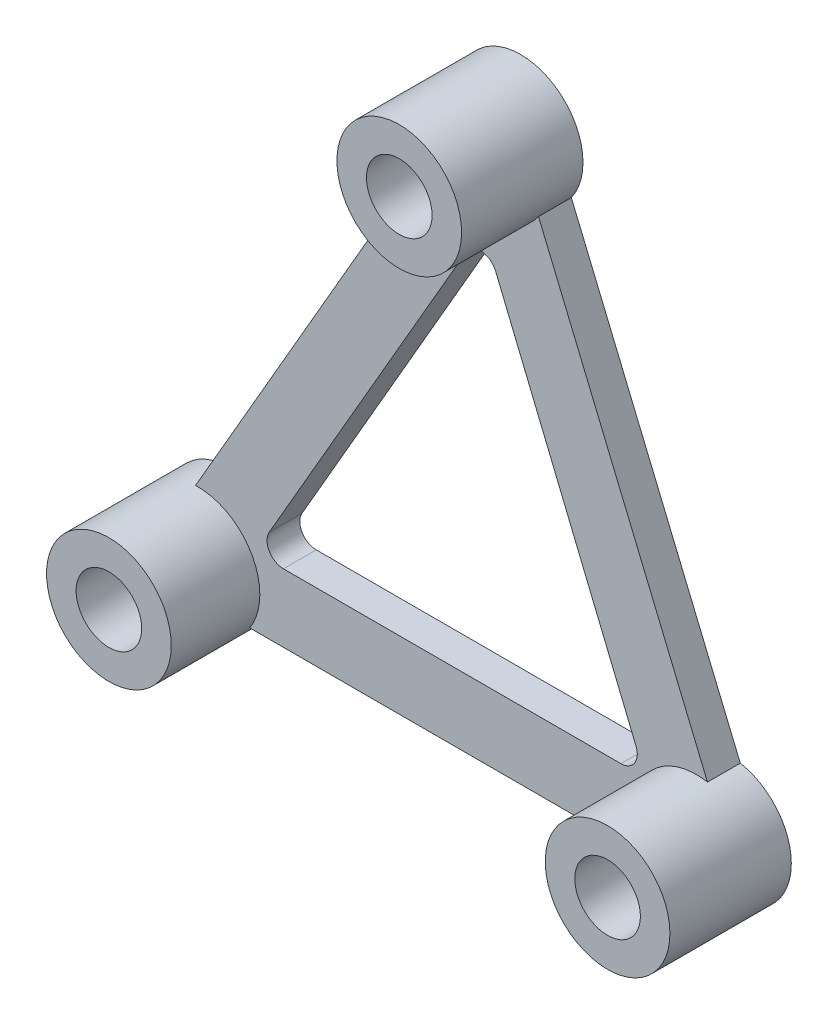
from build123d import *

# Parameters (mm, degrees)
BOSS_EXTRU_1_DEPTH      = 2
CONG_1_R                = 1
BOSS_EXTRU_2_DEPTH      = 5.4
BOSS_EXTRU_2_DEPTH_BACK = 2
ESQUISSE2_R             = 3.8
ESQUISSE2_R_2           = 2


with BuildPart() as part:
    # Esquisse1 → Boss.-Extru.1 (new body)
    with BuildSketch(Plane.XY):
        with BuildLine():
            Line((15.967949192, 31.657299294), (-2.006186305, 0.52518339))
            ThreePointArc((-2.006186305, 0.52518339), (-1.641602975, -1.267178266), (0, -2.073789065))
            Line((0, -2.073789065), (30.4, -2.073789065))
            ThreePointArc((30.4, -2.073789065), (32.125593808, -1.150185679), (32.31413227, 0.797934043))
            Line((32.31413227, 0.797934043), (19.546024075, 31.42684144))
            ThreePointArc((19.546024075, 31.42684144), (17.828550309, 32.653163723), (15.967949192, 31.657299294))
        make_face()
        Polygon((27.303688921, 2.073789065), (17.398650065, 26.135345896), (3.506703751, 2.073789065), align=None, mode=Mode.SUBTRACT)
    extrude(amount=BOSS_EXTRU_1_DEPTH)

    # Cong_1
    cong_1_edges = [part.edges().sort_by_distance(p)[0] for p in [
        (3.506703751, 2.073789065, 1),
        (27.303688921, 2.073789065, 1),
        (17.398650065, 26.135345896, 1),
    ]]
    fillet(cong_1_edges, radius=CONG_1_R)

    # Esquisse2 → Boss.-Extru.2 (add, two sides: drawn at the far end of the back side and taken through both)
    # profile 1 of 3: a face of its own
    with BuildSketch(Plane.XY.offset(2).offset(-BOSS_EXTRU_2_DEPTH_BACK)):
        Circle(ESQUISSE2_R)
        Circle(ESQUISSE2_R_2, mode=Mode.SUBTRACT)
    # profile 2 of 3: a face of its own
    with BuildSketch(Plane.XY.offset(2).offset(-BOSS_EXTRU_2_DEPTH_BACK)):
        with Locations((30.4, 0)):
            Circle(ESQUISSE2_R)
        with Locations((30.4, 0)):
            Circle(ESQUISSE2_R_2, mode=Mode.SUBTRACT)
    # profile 3 of 3: a face of its own
    with BuildSketch(Plane.XY.offset(2).offset(-BOSS_EXTRU_2_DEPTH_BACK)):
        with Locations((17.7, 30.657299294)):
            Circle(ESQUISSE2_R)
        with Locations((17.7, 30.657299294)):
            Circle(ESQUISSE2_R_2, mode=Mode.SUBTRACT)
    extrude(amount=BOSS_EXTRU_2_DEPTH + BOSS_EXTRU_2_DEPTH_BACK)


solid = part.part
